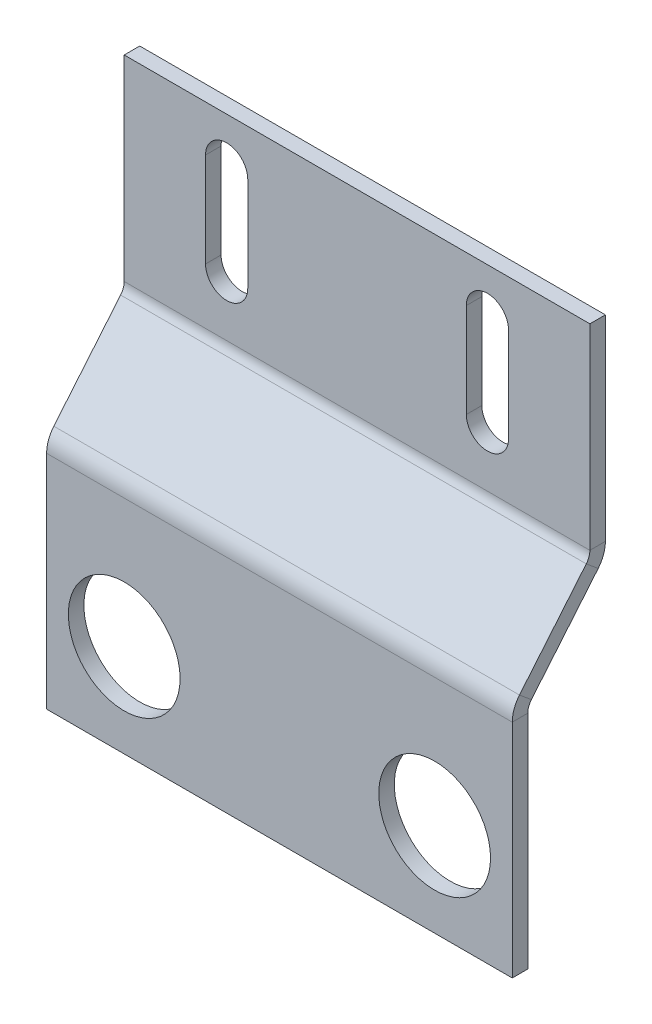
ISO-10303-21;
HEADER;
FILE_DESCRIPTION(('STEP AP214'),'2;1');
FILE_NAME('part.step','',(''),(''),'','','');
FILE_SCHEMA(('AUTOMOTIVE_DESIGN { 1 0 10303 214 1 1 1 1 }'));
ENDSEC;
DATA;
#1=APPLICATION_CONTEXT('core data for automotive mechanical design processes');
#2=APPLICATION_PROTOCOL_DEFINITION('international standard','automotive_design',2000,#1);
#3=PRODUCT_CONTEXT('',#1,'mechanical');
#4=PRODUCT('Part','Part','',(#3));
#5=PRODUCT_RELATED_PRODUCT_CATEGORY('part','',(#4));
#6=PRODUCT_DEFINITION_FORMATION('','',#4);
#7=PRODUCT_DEFINITION_CONTEXT('part definition',#1,'design');
#8=PRODUCT_DEFINITION('design','',#6,#7);
#9=PRODUCT_DEFINITION_SHAPE('','',#8);
#10=(LENGTH_UNIT() NAMED_UNIT(*) SI_UNIT(.MILLI.,.METRE.));
#11=(NAMED_UNIT(*) PLANE_ANGLE_UNIT() SI_UNIT($,.RADIAN.));
#12=(NAMED_UNIT(*) SI_UNIT($,.STERADIAN.) SOLID_ANGLE_UNIT());
#13=UNCERTAINTY_MEASURE_WITH_UNIT(LENGTH_MEASURE(1.E-05),#10,'distance_accuracy_value','');
#14=(GEOMETRIC_REPRESENTATION_CONTEXT(3) GLOBAL_UNCERTAINTY_ASSIGNED_CONTEXT((#13)) GLOBAL_UNIT_ASSIGNED_CONTEXT((#10,
#11,#12)) REPRESENTATION_CONTEXT('',''));
#15=CARTESIAN_POINT('',(0.,0.,0.));
#16=DIRECTION('',(0.,0.,1.));
#17=DIRECTION('',(1.,0.,0.));
#18=AXIS2_PLACEMENT_3D('',#15,#16,#17);
#19=CARTESIAN_POINT('',(37.5,38.8906723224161,-1.15889360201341));
#20=DIRECTION('',(1.,0.,0.));
#21=DIRECTION('',(0.,0.,-1.00000000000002));
#22=AXIS2_PLACEMENT_3D('',#19,#20,#21);
#23=PLANE('',#22);
#24=DIRECTION('',(0.,-0.64018439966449,-0.768221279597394));
#25=VECTOR('',#24,1.);
#26=CARTESIAN_POINT('',(37.5,38.8906723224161,-1.15889360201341));
#27=LINE('',#26,#25);
#28=CARTESIAN_POINT('',(37.5,38.8906723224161,-1.15889360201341));
#29=VERTEX_POINT('',#28);
#30=CARTESIAN_POINT('',(37.5,37.2902113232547,-3.0794468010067));
#31=VERTEX_POINT('',#30);
#32=EDGE_CURVE('E11',#29,#31,#27,.T.);
#33=ORIENTED_EDGE('',*,*,#32,.F.);
#34=CARTESIAN_POINT('',(37.5,35.6897503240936,-5.00000000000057));
#35=DIRECTION('',(1.,0.,0.));
#36=DIRECTION('',(0.,0.,-1.00000000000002));
#37=AXIS2_PLACEMENT_3D('',#34,#35,#36);
#38=CIRCLE('',#37,5.);
#39=CARTESIAN_POINT('',(37.5,35.6897503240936,-4.23272528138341E-13));
#40=VERTEX_POINT('',#39);
#41=EDGE_CURVE('E347',#40,#29,#38,.F.);
#42=ORIENTED_EDGE('',*,*,#41,.F.);
#43=DIRECTION('',(0.,0.,1.00000000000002));
#44=VECTOR('',#43,1.);
#45=CARTESIAN_POINT('',(37.5,35.6897503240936,-2.50000000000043));
#46=LINE('',#45,#44);
#47=CARTESIAN_POINT('',(37.5,35.6897503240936,-2.50000000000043));
#48=VERTEX_POINT('',#47);
#49=EDGE_CURVE('E46',#48,#40,#46,.T.);
#50=ORIENTED_EDGE('',*,*,#49,.F.);
#51=CARTESIAN_POINT('',(37.5,35.6897503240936,-5.00000000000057));
#52=DIRECTION('',(1.,0.,0.));
#53=DIRECTION('',(0.,0.,-1.00000000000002));
#54=AXIS2_PLACEMENT_3D('',#51,#52,#53);
#55=CIRCLE('',#54,2.5);
#56=EDGE_CURVE('E363',#48,#31,#55,.F.);
#57=ORIENTED_EDGE('',*,*,#56,.T.);
#58=EDGE_LOOP('',(#33,#42,#50,#57));
#59=FACE_BOUND('',#58,.T.);
#60=ADVANCED_FACE('F38',(#59),#23,.T.);
#61=CARTESIAN_POINT('',(37.5,35.6897503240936,-2.50000000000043));
#62=DIRECTION('',(1.,0.,0.));
#63=DIRECTION('',(0.,0.,-1.00000000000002));
#64=AXIS2_PLACEMENT_3D('',#61,#62,#63);
#65=PLANE('',#64);
#66=DIRECTION('',(0.,0.768221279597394,-0.640184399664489));
#67=VECTOR('',#66,1.);
#68=CARTESIAN_POINT('',(37.5,37.5000000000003,-1.45716771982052E-13));
#69=LINE('',#68,#67);
#70=CARTESIAN_POINT('',(37.5,51.8046638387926,-11.9205531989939));
#71=VERTEX_POINT('',#70);
#72=EDGE_CURVE('E343',#29,#71,#69,.T.);
#73=ORIENTED_EDGE('',*,*,#72,.F.);
#74=ORIENTED_EDGE('',*,*,#32,.T.);
#75=DIRECTION('',(0.,0.768221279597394,-0.640184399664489));
#76=VECTOR('',#75,1.);
#77=CARTESIAN_POINT('',(37.5,35.899539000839,-1.92055319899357));
#78=LINE('',#77,#76);
#79=CARTESIAN_POINT('',(37.5,50.2042028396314,-13.8411063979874));
#80=VERTEX_POINT('',#79);
#81=EDGE_CURVE('E367',#31,#80,#78,.T.);
#82=ORIENTED_EDGE('',*,*,#81,.T.);
#83=DIRECTION('',(0.,0.640184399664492,0.768221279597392));
#84=VECTOR('',#83,1.);
#85=CARTESIAN_POINT('',(37.5,50.2042028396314,-13.8411063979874));
#86=LINE('',#85,#84);
#87=EDGE_CURVE('E424',#80,#71,#86,.T.);
#88=ORIENTED_EDGE('',*,*,#87,.T.);
#89=EDGE_LOOP('',(#73,#74,#82,#88));
#90=FACE_BOUND('',#89,.T.);
#91=ADVANCED_FACE('F472',(#90),#65,.T.);
#92=CARTESIAN_POINT('',(-37.5,35.6897503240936,-3.95516952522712E-13));
#93=DIRECTION('',(-1.,0.,0.));
#94=DIRECTION('',(0.,0.,1.00000000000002));
#95=AXIS2_PLACEMENT_3D('',#92,#93,#94);
#96=PLANE('',#95);
#97=DIRECTION('',(0.,0.,-1.00000000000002));
#98=VECTOR('',#97,1.);
#99=CARTESIAN_POINT('',(-37.5,35.6897503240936,-3.95516952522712E-13));
#100=LINE('',#99,#98);
#101=CARTESIAN_POINT('',(-37.5,35.6897503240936,-3.95516952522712E-13));
#102=VERTEX_POINT('',#101);
#103=CARTESIAN_POINT('',(-37.5,35.6897503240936,-2.5000000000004));
#104=VERTEX_POINT('',#103);
#105=EDGE_CURVE('E433',#102,#104,#100,.T.);
#106=ORIENTED_EDGE('',*,*,#105,.F.);
#107=CARTESIAN_POINT('',(-37.5,35.6897503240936,-5.00000000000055));
#108=DIRECTION('',(1.,0.,0.));
#109=DIRECTION('',(0.,0.,-1.00000000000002));
#110=AXIS2_PLACEMENT_3D('',#107,#108,#109);
#111=CIRCLE('',#110,5.);
#112=CARTESIAN_POINT('',(-37.5,38.8906723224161,-1.15889360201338));
#113=VERTEX_POINT('',#112);
#114=EDGE_CURVE('E301',#102,#113,#111,.F.);
#115=ORIENTED_EDGE('',*,*,#114,.T.);
#116=DIRECTION('',(0.,0.64018439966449,0.768221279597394));
#117=VECTOR('',#116,1.);
#118=CARTESIAN_POINT('',(-37.5,37.2902113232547,-3.0794468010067));
#119=LINE('',#118,#117);
#120=CARTESIAN_POINT('',(-37.5,37.2902113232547,-3.0794468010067));
#121=VERTEX_POINT('',#120);
#122=EDGE_CURVE('E430',#121,#113,#119,.T.);
#123=ORIENTED_EDGE('',*,*,#122,.F.);
#124=CARTESIAN_POINT('',(-37.5,35.6897503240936,-5.00000000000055));
#125=DIRECTION('',(1.,0.,0.));
#126=DIRECTION('',(0.,0.,-1.00000000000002));
#127=AXIS2_PLACEMENT_3D('',#124,#125,#126);
#128=CIRCLE('',#127,2.5);
#129=EDGE_CURVE('E317',#104,#121,#128,.F.);
#130=ORIENTED_EDGE('',*,*,#129,.F.);
#131=EDGE_LOOP('',(#106,#115,#123,#130));
#132=FACE_BOUND('',#131,.T.);
#133=ADVANCED_FACE('F480',(#132),#96,.T.);
#134=CARTESIAN_POINT('',(-37.5,37.2902113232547,-3.0794468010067));
#135=DIRECTION('',(-1.,0.,0.));
#136=DIRECTION('',(0.,0.,1.00000000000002));
#137=AXIS2_PLACEMENT_3D('',#134,#135,#136);
#138=PLANE('',#137);
#139=DIRECTION('',(0.,1.00000000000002,0.));
#140=VECTOR('',#139,1.);
#141=CARTESIAN_POINT('',(-37.5,0.,0.));
#142=LINE('',#141,#140);
#143=CARTESIAN_POINT('',(-37.5,0.,0.));
#144=VERTEX_POINT('',#143);
#145=EDGE_CURVE('E305',#144,#102,#142,.T.);
#146=ORIENTED_EDGE('',*,*,#145,.T.);
#147=ORIENTED_EDGE('',*,*,#105,.T.);
#148=DIRECTION('',(0.,1.00000000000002,0.));
#149=VECTOR('',#148,1.);
#150=CARTESIAN_POINT('',(-37.5,0.,-2.5));
#151=LINE('',#150,#149);
#152=CARTESIAN_POINT('',(-37.5,0.,-2.5));
#153=VERTEX_POINT('',#152);
#154=EDGE_CURVE('E313',#153,#104,#151,.T.);
#155=ORIENTED_EDGE('',*,*,#154,.F.);
#156=DIRECTION('',(0.,0.,1.00000000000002));
#157=VECTOR('',#156,1.);
#158=CARTESIAN_POINT('',(-37.5,0.,-2.5));
#159=LINE('',#158,#157);
#160=EDGE_CURVE('E309',#153,#144,#159,.T.);
#161=ORIENTED_EDGE('',*,*,#160,.T.);
#162=EDGE_LOOP('',(#146,#147,#155,#161));
#163=FACE_BOUND('',#162,.T.);
#164=ADVANCED_FACE('F482',(#163),#138,.T.);
#165=CARTESIAN_POINT('',(37.5,53.4051248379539,-12.5000000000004));
#166=DIRECTION('',(1.,0.,0.));
#167=DIRECTION('',(0.,0.,-1.00000000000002));
#168=AXIS2_PLACEMENT_3D('',#165,#166,#167);
#169=PLANE('',#168);
#170=DIRECTION('',(0.,0.,-1.00000000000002));
#171=VECTOR('',#170,1.);
#172=CARTESIAN_POINT('',(37.5,53.4051248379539,-12.5000000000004));
#173=LINE('',#172,#171);
#174=CARTESIAN_POINT('',(37.5,53.4051248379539,-12.5000000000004));
#175=VERTEX_POINT('',#174);
#176=CARTESIAN_POINT('',(37.5,53.4051248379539,-15.0000000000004));
#177=VERTEX_POINT('',#176);
#178=EDGE_CURVE('E427',#175,#177,#173,.T.);
#179=ORIENTED_EDGE('',*,*,#178,.F.);
#180=CARTESIAN_POINT('',(37.5,53.4051248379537,-10.0000000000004));
#181=DIRECTION('',(-1.,0.,0.));
#182=DIRECTION('',(0.,0.,1.00000000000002));
#183=AXIS2_PLACEMENT_3D('',#180,#181,#182);
#184=CIRCLE('',#183,2.5);
#185=EDGE_CURVE('E339',#71,#175,#184,.F.);
#186=ORIENTED_EDGE('',*,*,#185,.F.);
#187=ORIENTED_EDGE('',*,*,#87,.F.);
#188=CARTESIAN_POINT('',(37.5,53.4051248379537,-10.0000000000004));
#189=DIRECTION('',(1.,0.,0.));
#190=DIRECTION('',(0.,0.,-1.00000000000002));
#191=AXIS2_PLACEMENT_3D('',#188,#189,#190);
#192=CIRCLE('',#191,5.);
#193=EDGE_CURVE('E371',#80,#177,#192,.T.);
#194=ORIENTED_EDGE('',*,*,#193,.T.);
#195=EDGE_LOOP('',(#179,#186,#187,#194));
#196=FACE_BOUND('',#195,.T.);
#197=ADVANCED_FACE('F484',(#196),#169,.T.);
#198=CARTESIAN_POINT('',(37.5,50.2042028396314,-13.8411063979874));
#199=DIRECTION('',(1.,0.,0.));
#200=DIRECTION('',(0.,0.,-1.00000000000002));
#201=AXIS2_PLACEMENT_3D('',#198,#199,#200);
#202=PLANE('',#201);
#203=DIRECTION('',(0.,1.00000000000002,0.));
#204=VECTOR('',#203,1.);
#205=CARTESIAN_POINT('',(37.5,52.5000000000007,-12.5000000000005));
#206=LINE('',#205,#204);
#207=CARTESIAN_POINT('',(37.5,85.0000000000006,-12.5000000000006));
#208=VERTEX_POINT('',#207);
#209=EDGE_CURVE('E335',#175,#208,#206,.T.);
#210=ORIENTED_EDGE('',*,*,#209,.F.);
#211=ORIENTED_EDGE('',*,*,#178,.T.);
#212=DIRECTION('',(0.,1.00000000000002,0.));
#213=VECTOR('',#212,1.);
#214=CARTESIAN_POINT('',(37.5,52.5000000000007,-15.0000000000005));
#215=LINE('',#214,#213);
#216=CARTESIAN_POINT('',(37.5,85.0000000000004,-15.0000000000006));
#217=VERTEX_POINT('',#216);
#218=EDGE_CURVE('E328',#177,#217,#215,.T.);
#219=ORIENTED_EDGE('',*,*,#218,.T.);
#220=DIRECTION('',(0.,0.,-1.00000000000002));
#221=VECTOR('',#220,1.);
#222=CARTESIAN_POINT('',(37.5,85.0000000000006,-12.5000000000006));
#223=LINE('',#222,#221);
#224=EDGE_CURVE('E331',#208,#217,#223,.T.);
#225=ORIENTED_EDGE('',*,*,#224,.F.);
#226=EDGE_LOOP('',(#210,#211,#219,#225));
#227=FACE_BOUND('',#226,.T.);
#228=ADVANCED_FACE('F490',(#227),#202,.T.);
#229=CARTESIAN_POINT('',(-37.5,51.8046638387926,-11.9205531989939));
#230=DIRECTION('',(-1.,0.,0.));
#231=DIRECTION('',(0.,0.,1.00000000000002));
#232=AXIS2_PLACEMENT_3D('',#229,#230,#231);
#233=PLANE('',#232);
#234=DIRECTION('',(0.,-0.640184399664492,-0.768221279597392));
#235=VECTOR('',#234,1.);
#236=CARTESIAN_POINT('',(-37.5,51.8046638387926,-11.9205531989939));
#237=LINE('',#236,#235);
#238=CARTESIAN_POINT('',(-37.5,51.8046638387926,-11.9205531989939));
#239=VERTEX_POINT('',#238);
#240=CARTESIAN_POINT('',(-37.5,50.2042028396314,-13.8411063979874));
#241=VERTEX_POINT('',#240);
#242=EDGE_CURVE('E421',#239,#241,#237,.T.);
#243=ORIENTED_EDGE('',*,*,#242,.F.);
#244=CARTESIAN_POINT('',(-37.5,53.4051248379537,-10.0000000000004));
#245=DIRECTION('',(-1.,0.,0.));
#246=DIRECTION('',(0.,0.,1.00000000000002));
#247=AXIS2_PLACEMENT_3D('',#244,#245,#246);
#248=CIRCLE('',#247,2.5);
#249=CARTESIAN_POINT('',(-37.5,53.4051248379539,-12.5000000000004));
#250=VERTEX_POINT('',#249);
#251=EDGE_CURVE('E293',#239,#250,#248,.F.);
#252=ORIENTED_EDGE('',*,*,#251,.T.);
#253=DIRECTION('',(0.,0.,1.00000000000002));
#254=VECTOR('',#253,1.);
#255=CARTESIAN_POINT('',(-37.5,53.4051248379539,-15.0000000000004));
#256=LINE('',#255,#254);
#257=CARTESIAN_POINT('',(-37.5,53.4051248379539,-15.0000000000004));
#258=VERTEX_POINT('',#257);
#259=EDGE_CURVE('E418',#258,#250,#256,.T.);
#260=ORIENTED_EDGE('',*,*,#259,.F.);
#261=CARTESIAN_POINT('',(-37.5,53.4051248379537,-10.0000000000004));
#262=DIRECTION('',(1.,0.,0.));
#263=DIRECTION('',(0.,0.,-1.00000000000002));
#264=AXIS2_PLACEMENT_3D('',#261,#262,#263);
#265=CIRCLE('',#264,5.);
#266=EDGE_CURVE('E324',#241,#258,#265,.T.);
#267=ORIENTED_EDGE('',*,*,#266,.F.);
#268=EDGE_LOOP('',(#243,#252,#260,#267));
#269=FACE_BOUND('',#268,.T.);
#270=ADVANCED_FACE('F520',(#269),#233,.T.);
#271=CARTESIAN_POINT('',(-37.5,53.4051248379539,-15.0000000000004));
#272=DIRECTION('',(-1.,0.,0.));
#273=DIRECTION('',(0.,0.,1.00000000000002));
#274=AXIS2_PLACEMENT_3D('',#271,#272,#273);
#275=PLANE('',#274);
#276=DIRECTION('',(0.,0.768221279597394,-0.640184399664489));
#277=VECTOR('',#276,1.);
#278=CARTESIAN_POINT('',(-37.5,37.5000000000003,-1.45716771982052E-13));
#279=LINE('',#278,#277);
#280=EDGE_CURVE('E297',#113,#239,#279,.T.);
#281=ORIENTED_EDGE('',*,*,#280,.T.);
#282=ORIENTED_EDGE('',*,*,#242,.T.);
#283=DIRECTION('',(0.,0.768221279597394,-0.640184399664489));
#284=VECTOR('',#283,1.);
#285=CARTESIAN_POINT('',(-37.5,35.899539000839,-1.92055319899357));
#286=LINE('',#285,#284);
#287=EDGE_CURVE('E321',#121,#241,#286,.T.);
#288=ORIENTED_EDGE('',*,*,#287,.F.);
#289=ORIENTED_EDGE('',*,*,#122,.T.);
#290=EDGE_LOOP('',(#281,#282,#288,#289));
#291=FACE_BOUND('',#290,.T.);
#292=ADVANCED_FACE('F529',(#291),#275,.T.);
#293=CARTESIAN_POINT('',(37.5,52.5000000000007,-15.0000000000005));
#294=DIRECTION('',(0.,0.,1.00000000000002));
#295=DIRECTION('',(1.,0.,0.));
#296=AXIS2_PLACEMENT_3D('',#293,#294,#295);
#297=PLANE('',#296);
#298=DIRECTION('',(0.,-1.00000000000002,0.));
#299=VECTOR('',#298,1.);
#300=CARTESIAN_POINT('',(-17.6,77.6000000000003,-14.9999999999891));
#301=LINE('',#300,#299);
#302=CARTESIAN_POINT('',(-17.6,77.6000000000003,-15.0000000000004));
#303=VERTEX_POINT('',#302);
#304=CARTESIAN_POINT('',(-17.6,62.4000000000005,-14.9999999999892));
#305=VERTEX_POINT('',#304);
#306=EDGE_CURVE('E199',#303,#305,#301,.T.);
#307=ORIENTED_EDGE('',*,*,#306,.F.);
#308=CARTESIAN_POINT('',(-21.,77.6000000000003,-14.9999999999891));
#309=DIRECTION('',(0.,0.,-1.00000000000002));
#310=DIRECTION('',(-1.,0.,0.));
#311=AXIS2_PLACEMENT_3D('',#308,#309,#310);
#312=CIRCLE('',#311,3.4);
#313=CARTESIAN_POINT('',(-24.4,77.6000000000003,-14.9999999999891));
#314=VERTEX_POINT('',#313);
#315=EDGE_CURVE('E53',#314,#303,#312,.T.);
#316=ORIENTED_EDGE('',*,*,#315,.F.);
#317=DIRECTION('',(0.,1.00000000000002,0.));
#318=VECTOR('',#317,1.);
#319=CARTESIAN_POINT('',(-24.4,77.6000000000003,-14.9999999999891));
#320=LINE('',#319,#318);
#321=CARTESIAN_POINT('',(-24.4,62.4000000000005,-14.9999999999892));
#322=VERTEX_POINT('',#321);
#323=EDGE_CURVE('E188',#322,#314,#320,.T.);
#324=ORIENTED_EDGE('',*,*,#323,.F.);
#325=CARTESIAN_POINT('',(-21.,62.4000000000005,-14.9999999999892));
#326=DIRECTION('',(0.,0.,-1.00000000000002));
#327=DIRECTION('',(-1.,0.,0.));
#328=AXIS2_PLACEMENT_3D('',#325,#326,#327);
#329=CIRCLE('',#328,3.4);
#330=EDGE_CURVE('E208',#305,#322,#329,.T.);
#331=ORIENTED_EDGE('',*,*,#330,.F.);
#332=EDGE_LOOP('',(#307,#316,#324,#331));
#333=FACE_BOUND('',#332,.T.);
#334=DIRECTION('',(0.,-1.00000000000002,0.));
#335=VECTOR('',#334,1.);
#336=CARTESIAN_POINT('',(24.4,77.6000000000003,-14.9999999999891));
#337=LINE('',#336,#335);
#338=CARTESIAN_POINT('',(24.4,77.6000000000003,-15.0000000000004));
#339=VERTEX_POINT('',#338);
#340=CARTESIAN_POINT('',(24.4,62.4000000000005,-14.9999999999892));
#341=VERTEX_POINT('',#340);
#342=EDGE_CURVE('E236',#339,#341,#337,.T.);
#343=ORIENTED_EDGE('',*,*,#342,.F.);
#344=CARTESIAN_POINT('',(21.,77.6000000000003,-14.9999999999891));
#345=DIRECTION('',(0.,0.,-1.00000000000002));
#346=DIRECTION('',(-1.,0.,0.));
#347=AXIS2_PLACEMENT_3D('',#344,#345,#346);
#348=CIRCLE('',#347,3.4);
#349=CARTESIAN_POINT('',(17.6,77.6000000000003,-14.9999999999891));
#350=VERTEX_POINT('',#349);
#351=EDGE_CURVE('E233',#350,#339,#348,.T.);
#352=ORIENTED_EDGE('',*,*,#351,.F.);
#353=DIRECTION('',(0.,1.00000000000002,0.));
#354=VECTOR('',#353,1.);
#355=CARTESIAN_POINT('',(17.6,77.6000000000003,-14.9999999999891));
#356=LINE('',#355,#354);
#357=CARTESIAN_POINT('',(17.6,62.4000000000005,-14.9999999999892));
#358=VERTEX_POINT('',#357);
#359=EDGE_CURVE('E244',#358,#350,#356,.T.);
#360=ORIENTED_EDGE('',*,*,#359,.F.);
#361=CARTESIAN_POINT('',(21.,62.4000000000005,-14.9999999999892));
#362=DIRECTION('',(0.,0.,-1.00000000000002));
#363=DIRECTION('',(-1.,0.,0.));
#364=AXIS2_PLACEMENT_3D('',#361,#362,#363);
#365=CIRCLE('',#364,3.4);
#366=EDGE_CURVE('E240',#341,#358,#365,.T.);
#367=ORIENTED_EDGE('',*,*,#366,.F.);
#368=EDGE_LOOP('',(#343,#352,#360,#367));
#369=FACE_BOUND('',#368,.T.);
#370=DIRECTION('',(0.,1.00000000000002,0.));
#371=VECTOR('',#370,1.);
#372=CARTESIAN_POINT('',(-37.5,52.5000000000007,-15.0000000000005));
#373=LINE('',#372,#371);
#374=CARTESIAN_POINT('',(-37.5,85.0000000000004,-15.0000000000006));
#375=VERTEX_POINT('',#374);
#376=EDGE_CURVE('E281',#258,#375,#373,.T.);
#377=ORIENTED_EDGE('',*,*,#376,.T.);
#378=DIRECTION('',(-1.,0.,0.));
#379=VECTOR('',#378,1.);
#380=CARTESIAN_POINT('',(37.5,85.0000000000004,-15.0000000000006));
#381=LINE('',#380,#379);
#382=EDGE_CURVE('E415',#217,#375,#381,.T.);
#383=ORIENTED_EDGE('',*,*,#382,.F.);
#384=ORIENTED_EDGE('',*,*,#218,.F.);
#385=DIRECTION('',(-1.,0.,0.));
#386=VECTOR('',#385,1.);
#387=CARTESIAN_POINT('',(37.5,53.4051248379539,-15.0000000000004));
#388=LINE('',#387,#386);
#389=EDGE_CURVE('E375',#177,#258,#388,.T.);
#390=ORIENTED_EDGE('',*,*,#389,.T.);
#391=EDGE_LOOP('',(#377,#383,#384,#390));
#392=FACE_BOUND('',#391,.T.);
#393=ADVANCED_FACE('F538',(#333,#369,#392),#297,.F.);
#394=CARTESIAN_POINT('',(37.5,85.0000000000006,-12.5000000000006));
#395=DIRECTION('',(0.,1.00000000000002,0.));
#396=DIRECTION('',(0.,0.,1.00000000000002));
#397=AXIS2_PLACEMENT_3D('',#394,#395,#396);
#398=PLANE('',#397);
#399=DIRECTION('',(0.,0.,-1.00000000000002));
#400=VECTOR('',#399,1.);
#401=CARTESIAN_POINT('',(-37.5,85.0000000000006,-12.5000000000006));
#402=LINE('',#401,#400);
#403=CARTESIAN_POINT('',(-37.5,85.0000000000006,-12.5000000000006));
#404=VERTEX_POINT('',#403);
#405=EDGE_CURVE('E285',#404,#375,#402,.T.);
#406=ORIENTED_EDGE('',*,*,#405,.F.);
#407=DIRECTION('',(-1.,0.,0.));
#408=VECTOR('',#407,1.);
#409=CARTESIAN_POINT('',(37.5,85.0000000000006,-12.5000000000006));
#410=LINE('',#409,#408);
#411=EDGE_CURVE('E412',#208,#404,#410,.T.);
#412=ORIENTED_EDGE('',*,*,#411,.F.);
#413=ORIENTED_EDGE('',*,*,#224,.T.);
#414=ORIENTED_EDGE('',*,*,#382,.T.);
#415=EDGE_LOOP('',(#406,#412,#413,#414));
#416=FACE_BOUND('',#415,.T.);
#417=ADVANCED_FACE('F546',(#416),#398,.T.);
#418=CARTESIAN_POINT('',(37.5,52.5000000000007,-12.5000000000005));
#419=DIRECTION('',(0.,0.,1.00000000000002));
#420=DIRECTION('',(1.,0.,0.));
#421=AXIS2_PLACEMENT_3D('',#418,#419,#420);
#422=PLANE('',#421);
#423=CARTESIAN_POINT('',(-21.,77.6000000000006,-12.5000000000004));
#424=DIRECTION('',(0.,0.,1.00000000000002));
#425=DIRECTION('',(1.,0.,0.));
#426=AXIS2_PLACEMENT_3D('',#423,#424,#425);
#427=CIRCLE('',#426,3.4);
#428=CARTESIAN_POINT('',(-24.4,77.6000000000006,-12.5000000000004));
#429=VERTEX_POINT('',#428);
#430=CARTESIAN_POINT('',(-17.6,77.6000000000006,-12.5000000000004));
#431=VERTEX_POINT('',#430);
#432=EDGE_CURVE('E185',#429,#431,#427,.F.);
#433=ORIENTED_EDGE('',*,*,#432,.T.);
#434=DIRECTION('',(0.,-1.00000000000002,0.));
#435=VECTOR('',#434,1.);
#436=CARTESIAN_POINT('',(-17.6,77.6000000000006,-12.5000000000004));
#437=LINE('',#436,#435);
#438=CARTESIAN_POINT('',(-17.6,62.4000000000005,-12.5000000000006));
#439=VERTEX_POINT('',#438);
#440=EDGE_CURVE('E173',#431,#439,#437,.T.);
#441=ORIENTED_EDGE('',*,*,#440,.T.);
#442=CARTESIAN_POINT('',(-21.,62.4000000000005,-12.5000000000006));
#443=DIRECTION('',(0.,0.,1.00000000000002));
#444=DIRECTION('',(1.,0.,0.));
#445=AXIS2_PLACEMENT_3D('',#442,#443,#444);
#446=CIRCLE('',#445,3.4);
#447=CARTESIAN_POINT('',(-24.4,62.4000000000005,-12.5000000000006));
#448=VERTEX_POINT('',#447);
#449=EDGE_CURVE('E202',#439,#448,#446,.F.);
#450=ORIENTED_EDGE('',*,*,#449,.T.);
#451=DIRECTION('',(0.,1.00000000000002,0.));
#452=VECTOR('',#451,1.);
#453=CARTESIAN_POINT('',(-24.4,77.6000000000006,-12.5000000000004));
#454=LINE('',#453,#452);
#455=EDGE_CURVE('E193',#448,#429,#454,.T.);
#456=ORIENTED_EDGE('',*,*,#455,.T.);
#457=EDGE_LOOP('',(#433,#441,#450,#456));
#458=FACE_BOUND('',#457,.T.);
#459=CARTESIAN_POINT('',(21.,77.6000000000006,-12.5000000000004));
#460=DIRECTION('',(0.,0.,1.00000000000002));
#461=DIRECTION('',(1.,0.,0.));
#462=AXIS2_PLACEMENT_3D('',#459,#460,#461);
#463=CIRCLE('',#462,3.4);
#464=CARTESIAN_POINT('',(17.6,77.6000000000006,-12.5000000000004));
#465=VERTEX_POINT('',#464);
#466=CARTESIAN_POINT('',(24.4,77.6000000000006,-12.5000000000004));
#467=VERTEX_POINT('',#466);
#468=EDGE_CURVE('E229',#465,#467,#463,.F.);
#469=ORIENTED_EDGE('',*,*,#468,.T.);
#470=DIRECTION('',(0.,-1.00000000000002,0.));
#471=VECTOR('',#470,1.);
#472=CARTESIAN_POINT('',(24.4,77.6000000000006,-12.5000000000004));
#473=LINE('',#472,#471);
#474=CARTESIAN_POINT('',(24.4,62.4000000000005,-12.5000000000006));
#475=VERTEX_POINT('',#474);
#476=EDGE_CURVE('E252',#467,#475,#473,.T.);
#477=ORIENTED_EDGE('',*,*,#476,.T.);
#478=CARTESIAN_POINT('',(21.,62.4000000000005,-12.5000000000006));
#479=DIRECTION('',(0.,0.,1.00000000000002));
#480=DIRECTION('',(1.,0.,0.));
#481=AXIS2_PLACEMENT_3D('',#478,#479,#480);
#482=CIRCLE('',#481,3.4);
#483=CARTESIAN_POINT('',(17.6,62.4000000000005,-12.5000000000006));
#484=VERTEX_POINT('',#483);
#485=EDGE_CURVE('E181',#475,#484,#482,.F.);
#486=ORIENTED_EDGE('',*,*,#485,.T.);
#487=DIRECTION('',(0.,1.00000000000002,0.));
#488=VECTOR('',#487,1.);
#489=CARTESIAN_POINT('',(17.6,77.6000000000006,-12.5000000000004));
#490=LINE('',#489,#488);
#491=EDGE_CURVE('E225',#484,#465,#490,.T.);
#492=ORIENTED_EDGE('',*,*,#491,.T.);
#493=EDGE_LOOP('',(#469,#477,#486,#492));
#494=FACE_BOUND('',#493,.T.);
#495=DIRECTION('',(0.,1.00000000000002,0.));
#496=VECTOR('',#495,1.);
#497=CARTESIAN_POINT('',(-37.5,52.5000000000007,-12.5000000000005));
#498=LINE('',#497,#496);
#499=EDGE_CURVE('E289',#250,#404,#498,.T.);
#500=ORIENTED_EDGE('',*,*,#499,.F.);
#501=DIRECTION('',(-1.,0.,0.));
#502=VECTOR('',#501,1.);
#503=CARTESIAN_POINT('',(37.5,53.4051248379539,-12.5000000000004));
#504=LINE('',#503,#502);
#505=EDGE_CURVE('E408',#175,#250,#504,.T.);
#506=ORIENTED_EDGE('',*,*,#505,.F.);
#507=ORIENTED_EDGE('',*,*,#209,.T.);
#508=ORIENTED_EDGE('',*,*,#411,.T.);
#509=EDGE_LOOP('',(#500,#506,#507,#508));
#510=FACE_BOUND('',#509,.T.);
#511=ADVANCED_FACE('F191',(#458,#494,#510),#422,.T.);
#512=CARTESIAN_POINT('',(37.5,53.4051248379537,-10.0000000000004));
#513=DIRECTION('',(-1.,0.,0.));
#514=DIRECTION('',(0.,0.,1.00000000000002));
#515=AXIS2_PLACEMENT_3D('',#512,#513,#514);
#516=CYLINDRICAL_SURFACE('',#515,2.5);
#517=ORIENTED_EDGE('',*,*,#251,.F.);
#518=DIRECTION('',(-1.,0.,0.));
#519=VECTOR('',#518,1.);
#520=CARTESIAN_POINT('',(37.5,51.8046638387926,-11.9205531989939));
#521=LINE('',#520,#519);
#522=EDGE_CURVE('E404',#71,#239,#521,.T.);
#523=ORIENTED_EDGE('',*,*,#522,.F.);
#524=ORIENTED_EDGE('',*,*,#185,.T.);
#525=ORIENTED_EDGE('',*,*,#505,.T.);
#526=EDGE_LOOP('',(#517,#523,#524,#525));
#527=FACE_BOUND('',#526,.T.);
#528=ADVANCED_FACE('F563',(#527),#516,.F.);
#529=CARTESIAN_POINT('',(37.5,37.5000000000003,-1.45716771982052E-13));
#530=DIRECTION('',(0.,0.640184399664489,0.768221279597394));
#531=DIRECTION('',(0.,-0.768221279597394,0.640184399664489));
#532=AXIS2_PLACEMENT_3D('',#529,#530,#531);
#533=PLANE('',#532);
#534=ORIENTED_EDGE('',*,*,#280,.F.);
#535=DIRECTION('',(-1.,0.,0.));
#536=VECTOR('',#535,1.);
#537=CARTESIAN_POINT('',(37.5,38.8906723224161,-1.15889360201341));
#538=LINE('',#537,#536);
#539=EDGE_CURVE('E400',#29,#113,#538,.T.);
#540=ORIENTED_EDGE('',*,*,#539,.F.);
#541=ORIENTED_EDGE('',*,*,#72,.T.);
#542=ORIENTED_EDGE('',*,*,#522,.T.);
#543=EDGE_LOOP('',(#534,#540,#541,#542));
#544=FACE_BOUND('',#543,.T.);
#545=ADVANCED_FACE('F476',(#544),#533,.T.);
#546=CARTESIAN_POINT('',(37.5,35.6897503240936,-5.00000000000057));
#547=DIRECTION('',(-1.,0.,0.));
#548=DIRECTION('',(0.,0.,1.00000000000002));
#549=AXIS2_PLACEMENT_3D('',#546,#547,#548);
#550=CYLINDRICAL_SURFACE('',#549,5.);
#551=ORIENTED_EDGE('',*,*,#114,.F.);
#552=DIRECTION('',(-1.,0.,0.));
#553=VECTOR('',#552,1.);
#554=CARTESIAN_POINT('',(37.5,35.6897503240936,-4.23272528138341E-13));
#555=LINE('',#554,#553);
#556=EDGE_CURVE('E397',#40,#102,#555,.T.);
#557=ORIENTED_EDGE('',*,*,#556,.F.);
#558=ORIENTED_EDGE('',*,*,#41,.T.);
#559=ORIENTED_EDGE('',*,*,#539,.T.);
#560=EDGE_LOOP('',(#551,#557,#558,#559));
#561=FACE_BOUND('',#560,.T.);
#562=ADVANCED_FACE('F448',(#561),#550,.T.);
#563=CARTESIAN_POINT('',(37.5,0.,0.));
#564=DIRECTION('',(0.,0.,1.00000000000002));
#565=DIRECTION('',(1.,0.,0.));
#566=AXIS2_PLACEMENT_3D('',#563,#564,#565);
#567=PLANE('',#566);
#568=CARTESIAN_POINT('',(25.,15.0000000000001,-2.77555756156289E-13));
#569=DIRECTION('',(0.,0.,1.00000000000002));
#570=DIRECTION('',(1.,0.,0.));
#571=AXIS2_PLACEMENT_3D('',#568,#569,#570);
#572=CIRCLE('',#571,9.00000000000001);
#573=CARTESIAN_POINT('',(34.,15.0000000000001,-2.77405872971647E-13));
#574=VERTEX_POINT('',#573);
#575=EDGE_CURVE('E265',#574,#574,#572,.T.);
#576=ORIENTED_EDGE('',*,*,#575,.F.);
#577=EDGE_LOOP('',(#576));
#578=FACE_BOUND('',#577,.T.);
#579=CARTESIAN_POINT('',(-25.,15.0000000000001,-2.77555756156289E-13));
#580=DIRECTION('',(0.,0.,1.00000000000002));
#581=DIRECTION('',(1.,0.,0.));
#582=AXIS2_PLACEMENT_3D('',#579,#580,#581);
#583=CIRCLE('',#582,9.00000000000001);
#584=CARTESIAN_POINT('',(-16.,15.0000000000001,-2.77405872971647E-13));
#585=VERTEX_POINT('',#584);
#586=EDGE_CURVE('E273',#585,#585,#583,.T.);
#587=ORIENTED_EDGE('',*,*,#586,.F.);
#588=EDGE_LOOP('',(#587));
#589=FACE_BOUND('',#588,.T.);
#590=ORIENTED_EDGE('',*,*,#145,.F.);
#591=DIRECTION('',(-1.,0.,0.));
#592=VECTOR('',#591,1.);
#593=CARTESIAN_POINT('',(37.5,0.,0.));
#594=LINE('',#593,#592);
#595=CARTESIAN_POINT('',(37.5,0.,0.));
#596=VERTEX_POINT('',#595);
#597=EDGE_CURVE('E394',#596,#144,#594,.T.);
#598=ORIENTED_EDGE('',*,*,#597,.F.);
#599=DIRECTION('',(0.,1.00000000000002,0.));
#600=VECTOR('',#599,1.);
#601=CARTESIAN_POINT('',(37.5,0.,0.));
#602=LINE('',#601,#600);
#603=EDGE_CURVE('E351',#596,#40,#602,.T.);
#604=ORIENTED_EDGE('',*,*,#603,.T.);
#605=ORIENTED_EDGE('',*,*,#556,.T.);
#606=EDGE_LOOP('',(#590,#598,#604,#605));
#607=FACE_BOUND('',#606,.T.);
#608=ADVANCED_FACE('F452',(#578,#589,#607),#567,.T.);
#609=CARTESIAN_POINT('',(37.5,0.,-2.5));
#610=DIRECTION('',(0.,-1.00000000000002,0.));
#611=DIRECTION('',(0.,0.,-1.00000000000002));
#612=AXIS2_PLACEMENT_3D('',#609,#610,#611);
#613=PLANE('',#612);
#614=ORIENTED_EDGE('',*,*,#160,.F.);
#615=DIRECTION('',(-1.,0.,0.));
#616=VECTOR('',#615,1.);
#617=CARTESIAN_POINT('',(37.5,0.,-2.5));
#618=LINE('',#617,#616);
#619=CARTESIAN_POINT('',(37.5,0.,-2.5));
#620=VERTEX_POINT('',#619);
#621=EDGE_CURVE('E391',#620,#153,#618,.T.);
#622=ORIENTED_EDGE('',*,*,#621,.F.);
#623=DIRECTION('',(0.,0.,1.00000000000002));
#624=VECTOR('',#623,1.);
#625=CARTESIAN_POINT('',(37.5,0.,-2.5));
#626=LINE('',#625,#624);
#627=EDGE_CURVE('E355',#620,#596,#626,.T.);
#628=ORIENTED_EDGE('',*,*,#627,.T.);
#629=ORIENTED_EDGE('',*,*,#597,.T.);
#630=EDGE_LOOP('',(#614,#622,#628,#629));
#631=FACE_BOUND('',#630,.T.);
#632=ADVANCED_FACE('F455',(#631),#613,.T.);
#633=CARTESIAN_POINT('',(37.5,0.,-2.5));
#634=DIRECTION('',(0.,0.,1.00000000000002));
#635=DIRECTION('',(1.,0.,0.));
#636=AXIS2_PLACEMENT_3D('',#633,#634,#635);
#637=PLANE('',#636);
#638=CARTESIAN_POINT('',(25.,15.0000000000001,-2.50000000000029));
#639=DIRECTION('',(0.,0.,1.00000000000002));
#640=DIRECTION('',(1.,0.,0.));
#641=AXIS2_PLACEMENT_3D('',#638,#639,#640);
#642=CIRCLE('',#641,9.00000000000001);
#643=CARTESIAN_POINT('',(34.,15.0000000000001,-2.50000000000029));
#644=VERTEX_POINT('',#643);
#645=EDGE_CURVE('E269',#644,#644,#642,.F.);
#646=ORIENTED_EDGE('',*,*,#645,.F.);
#647=EDGE_LOOP('',(#646));
#648=FACE_BOUND('',#647,.T.);
#649=CARTESIAN_POINT('',(-25.,15.0000000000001,-2.50000000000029));
#650=DIRECTION('',(0.,0.,1.00000000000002));
#651=DIRECTION('',(1.,0.,0.));
#652=AXIS2_PLACEMENT_3D('',#649,#650,#651);
#653=CIRCLE('',#652,9.00000000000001);
#654=CARTESIAN_POINT('',(-16.,15.0000000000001,-2.50000000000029));
#655=VERTEX_POINT('',#654);
#656=EDGE_CURVE('E277',#655,#655,#653,.F.);
#657=ORIENTED_EDGE('',*,*,#656,.F.);
#658=EDGE_LOOP('',(#657));
#659=FACE_BOUND('',#658,.T.);
#660=ORIENTED_EDGE('',*,*,#154,.T.);
#661=DIRECTION('',(-1.,0.,0.));
#662=VECTOR('',#661,1.);
#663=CARTESIAN_POINT('',(37.5,35.6897503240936,-2.50000000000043));
#664=LINE('',#663,#662);
#665=EDGE_CURVE('E387',#48,#104,#664,.T.);
#666=ORIENTED_EDGE('',*,*,#665,.F.);
#667=DIRECTION('',(0.,1.00000000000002,0.));
#668=VECTOR('',#667,1.);
#669=CARTESIAN_POINT('',(37.5,0.,-2.5));
#670=LINE('',#669,#668);
#671=EDGE_CURVE('E359',#620,#48,#670,.T.);
#672=ORIENTED_EDGE('',*,*,#671,.F.);
#673=ORIENTED_EDGE('',*,*,#621,.T.);
#674=EDGE_LOOP('',(#660,#666,#672,#673));
#675=FACE_BOUND('',#674,.T.);
#676=ADVANCED_FACE('F458',(#648,#659,#675),#637,.F.);
#677=CARTESIAN_POINT('',(37.5,35.6897503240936,-5.00000000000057));
#678=DIRECTION('',(-1.,0.,0.));
#679=DIRECTION('',(0.,0.,1.00000000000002));
#680=AXIS2_PLACEMENT_3D('',#677,#678,#679);
#681=CYLINDRICAL_SURFACE('',#680,2.5);
#682=ORIENTED_EDGE('',*,*,#129,.T.);
#683=DIRECTION('',(-1.,0.,0.));
#684=VECTOR('',#683,1.);
#685=CARTESIAN_POINT('',(37.5,37.2902113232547,-3.0794468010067));
#686=LINE('',#685,#684);
#687=EDGE_CURVE('E383',#31,#121,#686,.T.);
#688=ORIENTED_EDGE('',*,*,#687,.F.);
#689=ORIENTED_EDGE('',*,*,#56,.F.);
#690=ORIENTED_EDGE('',*,*,#665,.T.);
#691=EDGE_LOOP('',(#682,#688,#689,#690));
#692=FACE_BOUND('',#691,.T.);
#693=ADVANCED_FACE('F463',(#692),#681,.F.);
#694=CARTESIAN_POINT('',(37.5,35.899539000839,-1.92055319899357));
#695=DIRECTION('',(0.,0.640184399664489,0.768221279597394));
#696=DIRECTION('',(0.,-0.768221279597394,0.640184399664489));
#697=AXIS2_PLACEMENT_3D('',#694,#695,#696);
#698=PLANE('',#697);
#699=ORIENTED_EDGE('',*,*,#287,.T.);
#700=DIRECTION('',(-1.,0.,0.));
#701=VECTOR('',#700,1.);
#702=CARTESIAN_POINT('',(37.5,50.2042028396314,-13.8411063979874));
#703=LINE('',#702,#701);
#704=EDGE_CURVE('E379',#80,#241,#703,.T.);
#705=ORIENTED_EDGE('',*,*,#704,.F.);
#706=ORIENTED_EDGE('',*,*,#81,.F.);
#707=ORIENTED_EDGE('',*,*,#687,.T.);
#708=EDGE_LOOP('',(#699,#705,#706,#707));
#709=FACE_BOUND('',#708,.T.);
#710=ADVANCED_FACE('F468',(#709),#698,.F.);
#711=CARTESIAN_POINT('',(37.5,53.4051248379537,-10.0000000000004));
#712=DIRECTION('',(-1.,0.,0.));
#713=DIRECTION('',(0.,0.,1.00000000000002));
#714=AXIS2_PLACEMENT_3D('',#711,#712,#713);
#715=CYLINDRICAL_SURFACE('',#714,5.);
#716=ORIENTED_EDGE('',*,*,#266,.T.);
#717=ORIENTED_EDGE('',*,*,#389,.F.);
#718=ORIENTED_EDGE('',*,*,#193,.F.);
#719=ORIENTED_EDGE('',*,*,#704,.T.);
#720=EDGE_LOOP('',(#716,#717,#718,#719));
#721=FACE_BOUND('',#720,.T.);
#722=ADVANCED_FACE('F623',(#721),#715,.T.);
#723=CARTESIAN_POINT('',(37.5,53.4051248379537,-10.0000000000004));
#724=DIRECTION('',(-1.,0.,0.));
#725=DIRECTION('',(0.,0.,1.00000000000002));
#726=AXIS2_PLACEMENT_3D('',#723,#724,#725);
#727=PLANE('',#726);
#728=ORIENTED_EDGE('',*,*,#671,.T.);
#729=ORIENTED_EDGE('',*,*,#49,.T.);
#730=ORIENTED_EDGE('',*,*,#603,.F.);
#731=ORIENTED_EDGE('',*,*,#627,.F.);
#732=EDGE_LOOP('',(#728,#729,#730,#731));
#733=FACE_BOUND('',#732,.T.);
#734=ADVANCED_FACE('F440',(#733),#727,.F.);
#735=CARTESIAN_POINT('',(-37.5,53.4051248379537,-10.0000000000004));
#736=DIRECTION('',(-1.,0.,0.));
#737=DIRECTION('',(0.,0.,1.00000000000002));
#738=AXIS2_PLACEMENT_3D('',#735,#736,#737);
#739=PLANE('',#738);
#740=ORIENTED_EDGE('',*,*,#376,.F.);
#741=ORIENTED_EDGE('',*,*,#259,.T.);
#742=ORIENTED_EDGE('',*,*,#499,.T.);
#743=ORIENTED_EDGE('',*,*,#405,.T.);
#744=EDGE_LOOP('',(#740,#741,#742,#743));
#745=FACE_BOUND('',#744,.T.);
#746=ADVANCED_FACE('F639',(#745),#739,.T.);
#747=CARTESIAN_POINT('',(-25.,15.0000000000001,-15.0010000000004));
#748=DIRECTION('',(0.,0.,1.00000000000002));
#749=DIRECTION('',(1.,0.,0.));
#750=AXIS2_PLACEMENT_3D('',#747,#748,#749);
#751=CYLINDRICAL_SURFACE('',#750,9.00000000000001);
#752=ORIENTED_EDGE('',*,*,#586,.T.);
#753=EDGE_LOOP('',(#752));
#754=FACE_BOUND('',#753,.T.);
#755=ORIENTED_EDGE('',*,*,#656,.T.);
#756=EDGE_LOOP('',(#755));
#757=FACE_BOUND('',#756,.T.);
#758=ADVANCED_FACE('F647',(#754,#757),#751,.F.);
#759=CARTESIAN_POINT('',(25.,15.0000000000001,-15.0010000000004));
#760=DIRECTION('',(0.,0.,1.00000000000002));
#761=DIRECTION('',(1.,0.,0.));
#762=AXIS2_PLACEMENT_3D('',#759,#760,#761);
#763=CYLINDRICAL_SURFACE('',#762,9.00000000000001);
#764=ORIENTED_EDGE('',*,*,#575,.T.);
#765=EDGE_LOOP('',(#764));
#766=FACE_BOUND('',#765,.T.);
#767=ORIENTED_EDGE('',*,*,#645,.T.);
#768=EDGE_LOOP('',(#767));
#769=FACE_BOUND('',#768,.T.);
#770=ADVANCED_FACE('F656',(#766,#769),#763,.F.);
#771=CARTESIAN_POINT('',(21.,77.6000000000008,0.000999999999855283));
#772=DIRECTION('',(0.,0.,-1.00000000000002));
#773=DIRECTION('',(-1.,0.,0.));
#774=AXIS2_PLACEMENT_3D('',#771,#772,#773);
#775=CYLINDRICAL_SURFACE('',#774,3.4);
#776=DIRECTION('',(0.,0.,-1.00000000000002));
#777=VECTOR('',#776,1.);
#778=CARTESIAN_POINT('',(17.6,77.6000000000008,0.000999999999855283));
#779=LINE('',#778,#777);
#780=EDGE_CURVE('E249',#465,#350,#779,.T.);
#781=ORIENTED_EDGE('',*,*,#780,.T.);
#782=ORIENTED_EDGE('',*,*,#351,.T.);
#783=DIRECTION('',(0.,0.,-1.00000000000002));
#784=VECTOR('',#783,1.);
#785=CARTESIAN_POINT('',(24.4,77.6000000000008,0.000999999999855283));
#786=LINE('',#785,#784);
#787=EDGE_CURVE('E248',#467,#339,#786,.T.);
#788=ORIENTED_EDGE('',*,*,#787,.F.);
#789=ORIENTED_EDGE('',*,*,#468,.F.);
#790=EDGE_LOOP('',(#781,#782,#788,#789));
#791=FACE_BOUND('',#790,.T.);
#792=ADVANCED_FACE('F665',(#791),#775,.F.);
#793=CARTESIAN_POINT('',(17.6,77.6000000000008,0.000999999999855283));
#794=DIRECTION('',(-1.,0.,0.));
#795=DIRECTION('',(0.,0.,1.00000000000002));
#796=AXIS2_PLACEMENT_3D('',#793,#794,#795);
#797=PLANE('',#796);
#798=DIRECTION('',(0.,0.,-1.00000000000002));
#799=VECTOR('',#798,1.);
#800=CARTESIAN_POINT('',(17.6,62.4000000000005,0.000999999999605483));
#801=LINE('',#800,#799);
#802=EDGE_CURVE('E253',#484,#358,#801,.T.);
#803=ORIENTED_EDGE('',*,*,#802,.T.);
#804=ORIENTED_EDGE('',*,*,#359,.T.);
#805=ORIENTED_EDGE('',*,*,#780,.F.);
#806=ORIENTED_EDGE('',*,*,#491,.F.);
#807=EDGE_LOOP('',(#803,#804,#805,#806));
#808=FACE_BOUND('',#807,.T.);
#809=ADVANCED_FACE('F674',(#808),#797,.F.);
#810=CARTESIAN_POINT('',(21.,62.4000000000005,0.000999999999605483));
#811=DIRECTION('',(0.,0.,-1.00000000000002));
#812=DIRECTION('',(-1.,0.,0.));
#813=AXIS2_PLACEMENT_3D('',#810,#811,#812);
#814=CYLINDRICAL_SURFACE('',#813,3.4);
#815=DIRECTION('',(0.,0.,-1.00000000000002));
#816=VECTOR('',#815,1.);
#817=CARTESIAN_POINT('',(24.4,62.4000000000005,0.000999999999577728));
#818=LINE('',#817,#816);
#819=EDGE_CURVE('E256',#475,#341,#818,.T.);
#820=ORIENTED_EDGE('',*,*,#819,.T.);
#821=ORIENTED_EDGE('',*,*,#366,.T.);
#822=ORIENTED_EDGE('',*,*,#802,.F.);
#823=ORIENTED_EDGE('',*,*,#485,.F.);
#824=EDGE_LOOP('',(#820,#821,#822,#823));
#825=FACE_BOUND('',#824,.T.);
#826=ADVANCED_FACE('F683',(#825),#814,.F.);
#827=CARTESIAN_POINT('',(24.4,77.6000000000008,0.000999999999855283));
#828=DIRECTION('',(1.,0.,0.));
#829=DIRECTION('',(0.,0.,-1.00000000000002));
#830=AXIS2_PLACEMENT_3D('',#827,#828,#829);
#831=PLANE('',#830);
#832=ORIENTED_EDGE('',*,*,#787,.T.);
#833=ORIENTED_EDGE('',*,*,#342,.T.);
#834=ORIENTED_EDGE('',*,*,#819,.F.);
#835=ORIENTED_EDGE('',*,*,#476,.F.);
#836=EDGE_LOOP('',(#832,#833,#834,#835));
#837=FACE_BOUND('',#836,.T.);
#838=ADVANCED_FACE('F692',(#837),#831,.F.);
#839=CARTESIAN_POINT('',(-21.,77.6000000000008,0.000999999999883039));
#840=DIRECTION('',(0.,0.,-1.00000000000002));
#841=DIRECTION('',(-1.,0.,0.));
#842=AXIS2_PLACEMENT_3D('',#839,#840,#841);
#843=CYLINDRICAL_SURFACE('',#842,3.4);
#844=DIRECTION('',(0.,0.,-1.00000000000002));
#845=VECTOR('',#844,1.);
#846=CARTESIAN_POINT('',(-24.4,77.6000000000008,0.000999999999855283));
#847=LINE('',#846,#845);
#848=EDGE_CURVE('E182',#429,#314,#847,.T.);
#849=ORIENTED_EDGE('',*,*,#848,.T.);
#850=ORIENTED_EDGE('',*,*,#315,.T.);
#851=DIRECTION('',(0.,0.,-1.00000000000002));
#852=VECTOR('',#851,1.);
#853=CARTESIAN_POINT('',(-17.6,77.6000000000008,0.000999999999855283));
#854=LINE('',#853,#852);
#855=EDGE_CURVE('E175',#431,#303,#854,.T.);
#856=ORIENTED_EDGE('',*,*,#855,.F.);
#857=ORIENTED_EDGE('',*,*,#432,.F.);
#858=EDGE_LOOP('',(#849,#850,#856,#857));
#859=FACE_BOUND('',#858,.T.);
#860=ADVANCED_FACE('F184',(#859),#843,.F.);
#861=CARTESIAN_POINT('',(-24.4,77.6000000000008,0.000999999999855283));
#862=DIRECTION('',(-1.,0.,0.));
#863=DIRECTION('',(0.,0.,1.00000000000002));
#864=AXIS2_PLACEMENT_3D('',#861,#862,#863);
#865=PLANE('',#864);
#866=DIRECTION('',(0.,0.,-1.00000000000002));
#867=VECTOR('',#866,1.);
#868=CARTESIAN_POINT('',(-24.4,62.4000000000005,0.000999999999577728));
#869=LINE('',#868,#867);
#870=EDGE_CURVE('E217',#448,#322,#869,.T.);
#871=ORIENTED_EDGE('',*,*,#870,.T.);
#872=ORIENTED_EDGE('',*,*,#323,.T.);
#873=ORIENTED_EDGE('',*,*,#848,.F.);
#874=ORIENTED_EDGE('',*,*,#455,.F.);
#875=EDGE_LOOP('',(#871,#872,#873,#874));
#876=FACE_BOUND('',#875,.T.);
#877=ADVANCED_FACE('F709',(#876),#865,.F.);
#878=CARTESIAN_POINT('',(-21.,62.4000000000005,0.000999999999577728));
#879=DIRECTION('',(0.,0.,-1.00000000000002));
#880=DIRECTION('',(-1.,0.,0.));
#881=AXIS2_PLACEMENT_3D('',#878,#879,#880);
#882=CYLINDRICAL_SURFACE('',#881,3.4);
#883=DIRECTION('',(0.,0.,-1.00000000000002));
#884=VECTOR('',#883,1.);
#885=CARTESIAN_POINT('',(-17.6,62.4000000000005,0.000999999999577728));
#886=LINE('',#885,#884);
#887=EDGE_CURVE('E61',#439,#305,#886,.T.);
#888=ORIENTED_EDGE('',*,*,#887,.T.);
#889=ORIENTED_EDGE('',*,*,#330,.T.);
#890=ORIENTED_EDGE('',*,*,#870,.F.);
#891=ORIENTED_EDGE('',*,*,#449,.F.);
#892=EDGE_LOOP('',(#888,#889,#890,#891));
#893=FACE_BOUND('',#892,.T.);
#894=ADVANCED_FACE('F717',(#893),#882,.F.);
#895=CARTESIAN_POINT('',(-17.6,77.6000000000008,0.000999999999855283));
#896=DIRECTION('',(1.,0.,0.));
#897=DIRECTION('',(0.,0.,-1.00000000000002));
#898=AXIS2_PLACEMENT_3D('',#895,#896,#897);
#899=PLANE('',#898);
#900=ORIENTED_EDGE('',*,*,#855,.T.);
#901=ORIENTED_EDGE('',*,*,#306,.T.);
#902=ORIENTED_EDGE('',*,*,#887,.F.);
#903=ORIENTED_EDGE('',*,*,#440,.F.);
#904=EDGE_LOOP('',(#900,#901,#902,#903));
#905=FACE_BOUND('',#904,.T.);
#906=ADVANCED_FACE('F174',(#905),#899,.F.);
#907=CLOSED_SHELL('',(#60,#91,#133,#164,#197,#228,#270,#292,#393,#417,#511,#528,#545,#562,#608,
#632,#676,#693,#710,#722,#734,#746,#758,#770,#792,#809,#826,#838,#860,#877,#894,#906));
#908=MANIFOLD_SOLID_BREP('B2',#907);
#909=ADVANCED_BREP_SHAPE_REPRESENTATION('',(#18,#908),#14);
#910=SHAPE_DEFINITION_REPRESENTATION(#9,#909);
ENDSEC;
END-ISO-10303-21;
